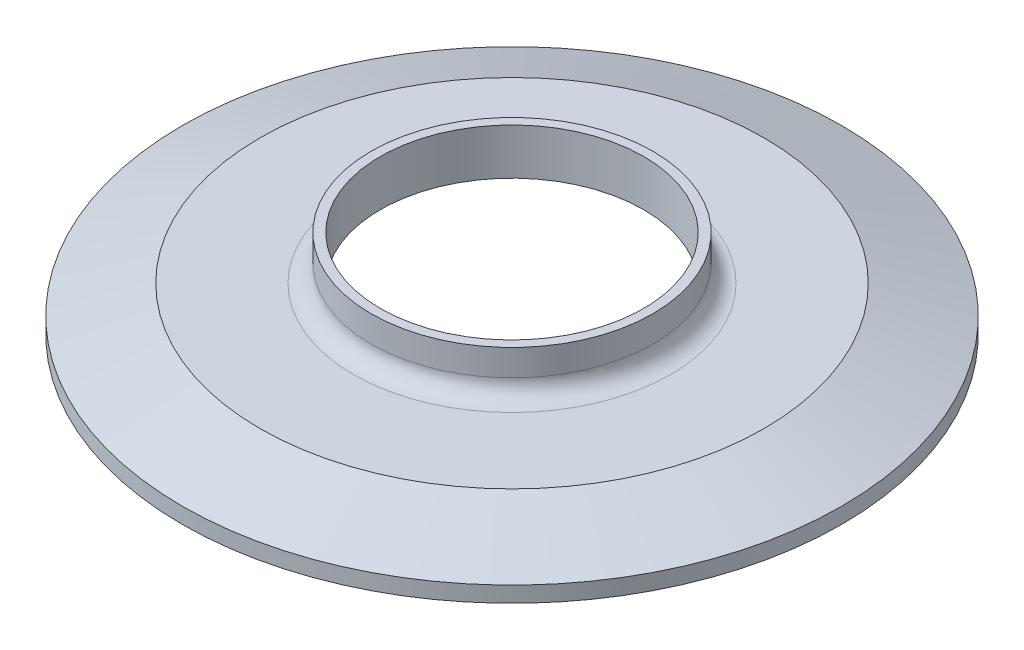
ISO-10303-21;
HEADER;
FILE_DESCRIPTION(('STEP AP214'),'2;1');
FILE_NAME('part.step','',(''),(''),'','','');
FILE_SCHEMA(('AUTOMOTIVE_DESIGN { 1 0 10303 214 1 1 1 1 }'));
ENDSEC;
DATA;
#1=APPLICATION_CONTEXT('core data for automotive mechanical design processes');
#2=APPLICATION_PROTOCOL_DEFINITION('international standard','automotive_design',2000,#1);
#3=PRODUCT_CONTEXT('',#1,'mechanical');
#4=PRODUCT('Part','Part','',(#3));
#5=PRODUCT_RELATED_PRODUCT_CATEGORY('part','',(#4));
#6=PRODUCT_DEFINITION_FORMATION('','',#4);
#7=PRODUCT_DEFINITION_CONTEXT('part definition',#1,'design');
#8=PRODUCT_DEFINITION('design','',#6,#7);
#9=PRODUCT_DEFINITION_SHAPE('','',#8);
#10=(LENGTH_UNIT() NAMED_UNIT(*) SI_UNIT(.MILLI.,.METRE.));
#11=(NAMED_UNIT(*) PLANE_ANGLE_UNIT() SI_UNIT($,.RADIAN.));
#12=(NAMED_UNIT(*) SI_UNIT($,.STERADIAN.) SOLID_ANGLE_UNIT());
#13=UNCERTAINTY_MEASURE_WITH_UNIT(LENGTH_MEASURE(1.E-05),#10,'distance_accuracy_value','');
#14=(GEOMETRIC_REPRESENTATION_CONTEXT(3) GLOBAL_UNCERTAINTY_ASSIGNED_CONTEXT((#13)) GLOBAL_UNIT_ASSIGNED_CONTEXT((#10,
#11,#12)) REPRESENTATION_CONTEXT('',''));
#15=CARTESIAN_POINT('',(0.,0.,0.));
#16=DIRECTION('',(0.,0.,1.));
#17=DIRECTION('',(1.,0.,0.));
#18=AXIS2_PLACEMENT_3D('',#15,#16,#17);
#19=CARTESIAN_POINT('',(-23.749,15.875,0.));
#20=DIRECTION('',(0.,-1.,0.));
#21=DIRECTION('',(0.,0.,-1.));
#22=AXIS2_PLACEMENT_3D('',#19,#20,#21);
#23=PLANE('',#22);
#24=CARTESIAN_POINT('',(0.,15.875,0.));
#25=DIRECTION('',(0.,-1.,0.));
#26=DIRECTION('',(0.,0.,-1.));
#27=AXIS2_PLACEMENT_3D('',#24,#25,#26);
#28=CIRCLE('',#27,25.4);
#29=CARTESIAN_POINT('',(0.,15.875,-25.4));
#30=VERTEX_POINT('',#29);
#31=EDGE_CURVE('E12',#30,#30,#28,.T.);
#32=ORIENTED_EDGE('',*,*,#31,.F.);
#33=EDGE_LOOP('',(#32));
#34=FACE_BOUND('',#33,.T.);
#35=CARTESIAN_POINT('',(0.,15.875,0.));
#36=DIRECTION('',(0.,-1.,0.));
#37=DIRECTION('',(0.,0.,-1.));
#38=AXIS2_PLACEMENT_3D('',#35,#36,#37);
#39=CIRCLE('',#38,23.749);
#40=CARTESIAN_POINT('',(0.,15.875,-23.749));
#41=VERTEX_POINT('',#40);
#42=EDGE_CURVE('E87',#41,#41,#39,.T.);
#43=ORIENTED_EDGE('',*,*,#42,.T.);
#44=EDGE_LOOP('',(#43));
#45=FACE_BOUND('',#44,.T.);
#46=ADVANCED_FACE('F38',(#34,#45),#23,.F.);
#47=CARTESIAN_POINT('',(0.,0.,0.));
#48=DIRECTION('',(0.,-1.,0.));
#49=DIRECTION('',(0.,0.,-1.));
#50=AXIS2_PLACEMENT_3D('',#47,#48,#49);
#51=CYLINDRICAL_SURFACE('',#50,25.4);
#52=CARTESIAN_POINT('',(0.,11.1252,0.));
#53=DIRECTION('',(0.,-1.,0.));
#54=DIRECTION('',(0.,0.,-1.));
#55=AXIS2_PLACEMENT_3D('',#52,#53,#54);
#56=CIRCLE('',#55,25.4);
#57=CARTESIAN_POINT('',(0.,11.1252,-25.4));
#58=VERTEX_POINT('',#57);
#59=EDGE_CURVE('E44',#58,#58,#56,.T.);
#60=ORIENTED_EDGE('',*,*,#59,.F.);
#61=EDGE_LOOP('',(#60));
#62=FACE_BOUND('',#61,.T.);
#63=ORIENTED_EDGE('',*,*,#31,.T.);
#64=EDGE_LOOP('',(#63));
#65=FACE_BOUND('',#64,.T.);
#66=ADVANCED_FACE('F166',(#62,#65),#51,.T.);
#67=CARTESIAN_POINT('',(0.,11.1252,0.));
#68=DIRECTION('',(0.,-1.,0.));
#69=DIRECTION('',(0.,0.,-1.));
#70=AXIS2_PLACEMENT_3D('',#67,#68,#69);
#71=TOROIDAL_SURFACE('',#70,28.575,3.175);
#72=CARTESIAN_POINT('',(0.,7.9502,0.));
#73=DIRECTION('',(0.,-1.,0.));
#74=DIRECTION('',(0.,0.,-1.));
#75=AXIS2_PLACEMENT_3D('',#72,#73,#74);
#76=CIRCLE('',#75,28.575);
#77=CARTESIAN_POINT('',(0.,7.9502,-28.575));
#78=VERTEX_POINT('',#77);
#79=EDGE_CURVE('E48',#78,#78,#76,.T.);
#80=ORIENTED_EDGE('',*,*,#79,.F.);
#81=EDGE_LOOP('',(#80));
#82=FACE_BOUND('',#81,.T.);
#83=ORIENTED_EDGE('',*,*,#59,.T.);
#84=EDGE_LOOP('',(#83));
#85=FACE_BOUND('',#84,.T.);
#86=ADVANCED_FACE('F161',(#82,#85),#71,.F.);
#87=CARTESIAN_POINT('',(-28.575,7.9502,0.));
#88=DIRECTION('',(0.,-1.,0.));
#89=DIRECTION('',(0.,0.,-1.));
#90=AXIS2_PLACEMENT_3D('',#87,#88,#89);
#91=PLANE('',#90);
#92=CARTESIAN_POINT('',(0.,7.9502,0.));
#93=DIRECTION('',(0.,-1.,0.));
#94=DIRECTION('',(0.,0.,-1.));
#95=AXIS2_PLACEMENT_3D('',#92,#93,#94);
#96=CIRCLE('',#95,45.4344287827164);
#97=CARTESIAN_POINT('',(0.,7.9502,-45.4344287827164));
#98=VERTEX_POINT('',#97);
#99=EDGE_CURVE('E52',#98,#98,#96,.T.);
#100=ORIENTED_EDGE('',*,*,#99,.F.);
#101=EDGE_LOOP('',(#100));
#102=FACE_BOUND('',#101,.T.);
#103=ORIENTED_EDGE('',*,*,#79,.T.);
#104=EDGE_LOOP('',(#103));
#105=FACE_BOUND('',#104,.T.);
#106=ADVANCED_FACE('F155',(#102,#105),#91,.F.);
#107=CARTESIAN_POINT('',(0.,7.9502,0.));
#108=DIRECTION('',(0.,-1.,0.));
#109=DIRECTION('',(0.,0.,-1.));
#110=AXIS2_PLACEMENT_3D('',#107,#108,#109);
#111=CONICAL_SURFACE('',#110,45.4344287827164,1.22173047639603);
#112=CARTESIAN_POINT('',(0.,2.8448,0.));
#113=DIRECTION('',(0.,-1.,0.));
#114=DIRECTION('',(0.,0.,-1.));
#115=AXIS2_PLACEMENT_3D('',#112,#113,#114);
#116=CIRCLE('',#115,59.4614);
#117=CARTESIAN_POINT('',(0.,2.8448,-59.4614));
#118=VERTEX_POINT('',#117);
#119=EDGE_CURVE('E57',#118,#118,#116,.T.);
#120=ORIENTED_EDGE('',*,*,#119,.F.);
#121=EDGE_LOOP('',(#120));
#122=FACE_BOUND('',#121,.T.);
#123=ORIENTED_EDGE('',*,*,#99,.T.);
#124=EDGE_LOOP('',(#123));
#125=FACE_BOUND('',#124,.T.);
#126=ADVANCED_FACE('F149',(#122,#125),#111,.T.);
#127=CARTESIAN_POINT('',(0.,0.,0.));
#128=DIRECTION('',(0.,-1.,0.));
#129=DIRECTION('',(0.,0.,-1.));
#130=AXIS2_PLACEMENT_3D('',#127,#128,#129);
#131=CYLINDRICAL_SURFACE('',#130,59.4614);
#132=CARTESIAN_POINT('',(0.,0.,0.));
#133=DIRECTION('',(0.,-1.,0.));
#134=DIRECTION('',(0.,0.,-1.));
#135=AXIS2_PLACEMENT_3D('',#132,#133,#134);
#136=CIRCLE('',#135,59.4614);
#137=CARTESIAN_POINT('',(0.,0.,-59.4614));
#138=VERTEX_POINT('',#137);
#139=EDGE_CURVE('E60',#138,#138,#136,.T.);
#140=ORIENTED_EDGE('',*,*,#139,.F.);
#141=EDGE_LOOP('',(#140));
#142=FACE_BOUND('',#141,.T.);
#143=ORIENTED_EDGE('',*,*,#119,.T.);
#144=EDGE_LOOP('',(#143));
#145=FACE_BOUND('',#144,.T.);
#146=ADVANCED_FACE('F143',(#142,#145),#131,.T.);
#147=CARTESIAN_POINT('',(-59.4614,0.,0.));
#148=DIRECTION('',(0.,1.,0.));
#149=DIRECTION('',(0.,0.,1.));
#150=AXIS2_PLACEMENT_3D('',#147,#148,#149);
#151=PLANE('',#150);
#152=CARTESIAN_POINT('',(0.,0.,0.));
#153=DIRECTION('',(0.,-1.,0.));
#154=DIRECTION('',(0.,0.,-1.));
#155=AXIS2_PLACEMENT_3D('',#152,#153,#154);
#156=CIRCLE('',#155,56.924857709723);
#157=CARTESIAN_POINT('',(0.,0.,-56.924857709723));
#158=VERTEX_POINT('',#157);
#159=EDGE_CURVE('E63',#158,#158,#156,.T.);
#160=ORIENTED_EDGE('',*,*,#159,.F.);
#161=EDGE_LOOP('',(#160));
#162=FACE_BOUND('',#161,.T.);
#163=ORIENTED_EDGE('',*,*,#139,.T.);
#164=EDGE_LOOP('',(#163));
#165=FACE_BOUND('',#164,.T.);
#166=ADVANCED_FACE('F137',(#162,#165),#151,.F.);
#167=CARTESIAN_POINT('',(0.,0.776719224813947,0.));
#168=DIRECTION('',(0.,-1.,0.));
#169=DIRECTION('',(0.,0.,-1.));
#170=AXIS2_PLACEMENT_3D('',#167,#168,#169);
#171=TOROIDAL_SURFACE('',#170,56.7956059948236,0.787400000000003);
#172=CARTESIAN_POINT('',(0.,0.469057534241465,0.));
#173=DIRECTION('',(0.,-1.,0.));
#174=DIRECTION('',(0.,0.,-1.));
#175=AXIS2_PLACEMENT_3D('',#172,#173,#174);
#176=CIRCLE('',#175,56.0708004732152);
#177=CARTESIAN_POINT('',(0.,0.469057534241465,-56.0708004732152));
#178=VERTEX_POINT('',#177);
#179=EDGE_CURVE('E66',#178,#178,#176,.T.);
#180=ORIENTED_EDGE('',*,*,#179,.F.);
#181=EDGE_LOOP('',(#180));
#182=FACE_BOUND('',#181,.T.);
#183=ORIENTED_EDGE('',*,*,#159,.T.);
#184=EDGE_LOOP('',(#183));
#185=FACE_BOUND('',#184,.T.);
#186=ADVANCED_FACE('F131',(#182,#185),#171,.T.);
#187=CARTESIAN_POINT('',(0.,0.469057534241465,0.));
#188=DIRECTION('',(0.,-1.,0.));
#189=DIRECTION('',(0.,0.,-1.));
#190=AXIS2_PLACEMENT_3D('',#187,#188,#189);
#191=CONICAL_SURFACE('',#190,56.0708004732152,0.401425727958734);
#192=CARTESIAN_POINT('',(0.,0.872854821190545,0.));
#193=DIRECTION('',(0.,-1.,0.));
#194=DIRECTION('',(0.,0.,-1.));
#195=AXIS2_PLACEMENT_3D('',#192,#193,#194);
#196=CIRCLE('',#195,55.8993986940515);
#197=CARTESIAN_POINT('',(0.,0.872854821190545,-55.8993986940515));
#198=VERTEX_POINT('',#197);
#199=EDGE_CURVE('E69',#198,#198,#196,.T.);
#200=ORIENTED_EDGE('',*,*,#199,.F.);
#201=EDGE_LOOP('',(#200));
#202=FACE_BOUND('',#201,.T.);
#203=ORIENTED_EDGE('',*,*,#179,.T.);
#204=EDGE_LOOP('',(#203));
#205=FACE_BOUND('',#204,.T.);
#206=ADVANCED_FACE('F125',(#202,#205),#191,.F.);
#207=CARTESIAN_POINT('',(0.,0.406400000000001,0.));
#208=DIRECTION('',(0.,-1.,0.));
#209=DIRECTION('',(0.,0.,-1.));
#210=AXIS2_PLACEMENT_3D('',#207,#208,#209);
#211=TOROIDAL_SURFACE('',#210,54.8005,1.1938);
#212=CARTESIAN_POINT('',(0.,0.872854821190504,0.));
#213=DIRECTION('',(0.,-1.,0.));
#214=DIRECTION('',(0.,0.,-1.));
#215=AXIS2_PLACEMENT_3D('',#212,#213,#214);
#216=CIRCLE('',#215,53.7016013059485);
#217=CARTESIAN_POINT('',(0.,0.872854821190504,-53.7016013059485));
#218=VERTEX_POINT('',#217);
#219=EDGE_CURVE('E72',#218,#218,#216,.T.);
#220=ORIENTED_EDGE('',*,*,#219,.F.);
#221=EDGE_LOOP('',(#220));
#222=FACE_BOUND('',#221,.T.);
#223=ORIENTED_EDGE('',*,*,#199,.T.);
#224=EDGE_LOOP('',(#223));
#225=FACE_BOUND('',#224,.T.);
#226=ADVANCED_FACE('F119',(#222,#225),#211,.F.);
#227=CARTESIAN_POINT('',(0.,0.872854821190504,0.));
#228=DIRECTION('',(0.,1.,0.));
#229=DIRECTION('',(0.,0.,1.));
#230=AXIS2_PLACEMENT_3D('',#227,#228,#229);
#231=CONICAL_SURFACE('',#230,53.7016013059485,0.401425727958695);
#232=CARTESIAN_POINT('',(0.,0.479738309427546,0.));
#233=DIRECTION('',(0.,-1.,0.));
#234=DIRECTION('',(0.,0.,-1.));
#235=AXIS2_PLACEMENT_3D('',#232,#233,#234);
#236=CIRCLE('',#235,53.5347332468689);
#237=CARTESIAN_POINT('',(0.,0.479738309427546,-53.5347332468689));
#238=VERTEX_POINT('',#237);
#239=EDGE_CURVE('E75',#238,#238,#236,.T.);
#240=ORIENTED_EDGE('',*,*,#239,.F.);
#241=EDGE_LOOP('',(#240));
#242=FACE_BOUND('',#241,.T.);
#243=ORIENTED_EDGE('',*,*,#219,.T.);
#244=EDGE_LOOP('',(#243));
#245=FACE_BOUND('',#244,.T.);
#246=ADVANCED_FACE('F113',(#242,#245),#231,.T.);
#247=CARTESIAN_POINT('',(0.,0.787400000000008,0.));
#248=DIRECTION('',(0.,-1.,0.));
#249=DIRECTION('',(0.,0.,-1.));
#250=AXIS2_PLACEMENT_3D('',#247,#248,#249);
#251=TOROIDAL_SURFACE('',#250,52.8099277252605,0.787399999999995);
#252=CARTESIAN_POINT('',(0.,0.,0.));
#253=DIRECTION('',(0.,-1.,0.));
#254=DIRECTION('',(0.,0.,-1.));
#255=AXIS2_PLACEMENT_3D('',#252,#253,#254);
#256=CIRCLE('',#255,52.8099277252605);
#257=CARTESIAN_POINT('',(0.,0.,-52.8099277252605));
#258=VERTEX_POINT('',#257);
#259=EDGE_CURVE('E78',#258,#258,#256,.T.);
#260=ORIENTED_EDGE('',*,*,#259,.F.);
#261=EDGE_LOOP('',(#260));
#262=FACE_BOUND('',#261,.T.);
#263=ORIENTED_EDGE('',*,*,#239,.T.);
#264=EDGE_LOOP('',(#263));
#265=FACE_BOUND('',#264,.T.);
#266=ADVANCED_FACE('F107',(#262,#265),#251,.T.);
#267=CARTESIAN_POINT('',(-48.6918,0.,0.));
#268=DIRECTION('',(0.,1.,0.));
#269=DIRECTION('',(0.,0.,1.));
#270=AXIS2_PLACEMENT_3D('',#267,#268,#269);
#271=PLANE('',#270);
#272=CARTESIAN_POINT('',(0.,0.,0.));
#273=DIRECTION('',(0.,-1.,0.));
#274=DIRECTION('',(0.,0.,-1.));
#275=AXIS2_PLACEMENT_3D('',#272,#273,#274);
#276=CIRCLE('',#275,48.6918);
#277=CARTESIAN_POINT('',(0.,0.,-48.6918));
#278=VERTEX_POINT('',#277);
#279=EDGE_CURVE('E81',#278,#278,#276,.T.);
#280=ORIENTED_EDGE('',*,*,#279,.F.);
#281=EDGE_LOOP('',(#280));
#282=FACE_BOUND('',#281,.T.);
#283=ORIENTED_EDGE('',*,*,#259,.T.);
#284=EDGE_LOOP('',(#283));
#285=FACE_BOUND('',#284,.T.);
#286=ADVANCED_FACE('F101',(#282,#285),#271,.F.);
#287=CARTESIAN_POINT('',(0.,0.,0.));
#288=DIRECTION('',(0.,-1.,0.));
#289=DIRECTION('',(0.,0.,-1.));
#290=AXIS2_PLACEMENT_3D('',#287,#288,#289);
#291=CONICAL_SURFACE('',#290,48.6918,1.27635928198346);
#292=CARTESIAN_POINT('',(0.,7.56393875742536,0.));
#293=DIRECTION('',(0.,-1.,0.));
#294=DIRECTION('',(0.,0.,-1.));
#295=AXIS2_PLACEMENT_3D('',#292,#293,#294);
#296=CIRCLE('',#295,23.749);
#297=CARTESIAN_POINT('',(0.,7.56393875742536,-23.749));
#298=VERTEX_POINT('',#297);
#299=EDGE_CURVE('E84',#298,#298,#296,.T.);
#300=ORIENTED_EDGE('',*,*,#299,.F.);
#301=EDGE_LOOP('',(#300));
#302=FACE_BOUND('',#301,.T.);
#303=ORIENTED_EDGE('',*,*,#279,.T.);
#304=EDGE_LOOP('',(#303));
#305=FACE_BOUND('',#304,.T.);
#306=ADVANCED_FACE('F95',(#302,#305),#291,.F.);
#307=CARTESIAN_POINT('',(0.,0.,0.));
#308=DIRECTION('',(0.,-1.,0.));
#309=DIRECTION('',(0.,0.,-1.));
#310=AXIS2_PLACEMENT_3D('',#307,#308,#309);
#311=CYLINDRICAL_SURFACE('',#310,23.749);
#312=ORIENTED_EDGE('',*,*,#42,.F.);
#313=EDGE_LOOP('',(#312));
#314=FACE_BOUND('',#313,.T.);
#315=ORIENTED_EDGE('',*,*,#299,.T.);
#316=EDGE_LOOP('',(#315));
#317=FACE_BOUND('',#316,.T.);
#318=ADVANCED_FACE('F92',(#314,#317),#311,.F.);
#319=CLOSED_SHELL('',(#46,#66,#86,#106,#126,#146,#166,#186,#206,#226,#246,#266,#286,#306,#318));
#320=MANIFOLD_SOLID_BREP('B2',#319);
#321=ADVANCED_BREP_SHAPE_REPRESENTATION('',(#18,#320),#14);
#322=SHAPE_DEFINITION_REPRESENTATION(#9,#321);
ENDSEC;
END-ISO-10303-21;
